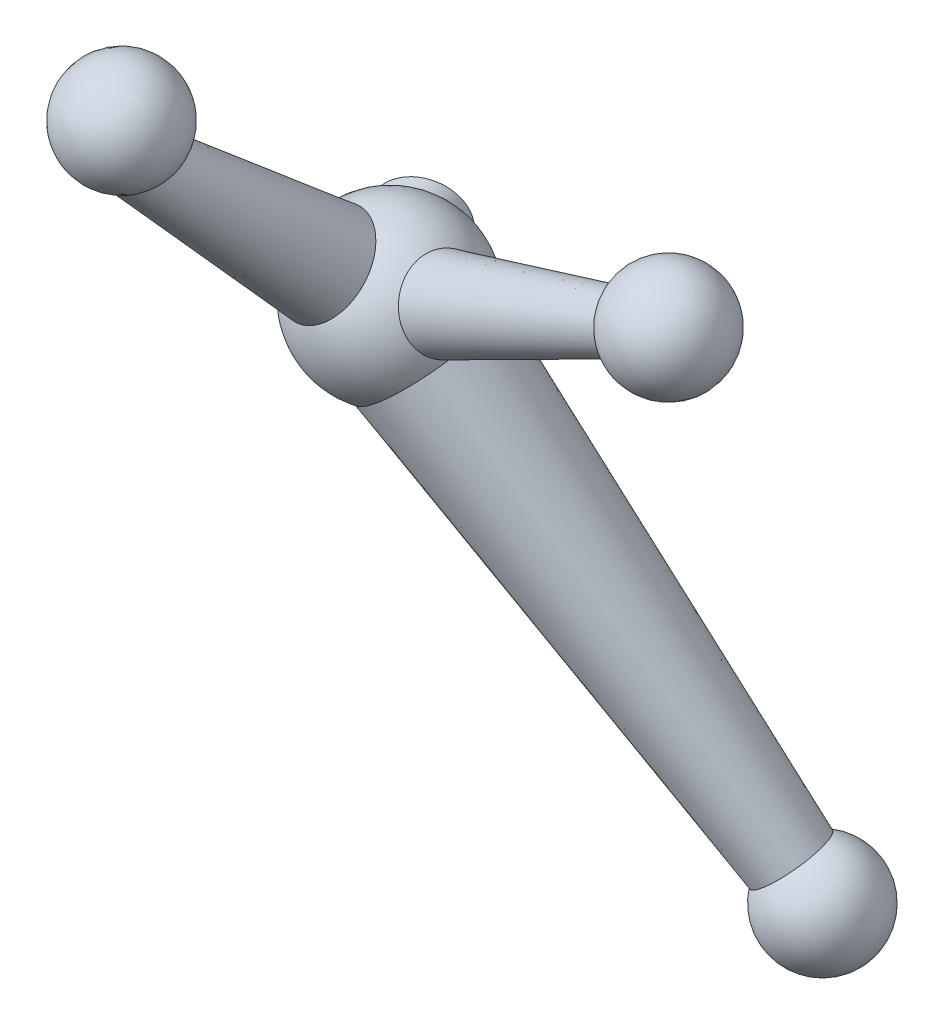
ISO-10303-21;
HEADER;
FILE_DESCRIPTION(('STEP AP214'),'2;1');
FILE_NAME('part.step','',(''),(''),'','','');
FILE_SCHEMA(('AUTOMOTIVE_DESIGN { 1 0 10303 214 1 1 1 1 }'));
ENDSEC;
DATA;
#1=APPLICATION_CONTEXT('core data for automotive mechanical design processes');
#2=APPLICATION_PROTOCOL_DEFINITION('international standard','automotive_design',2000,#1);
#3=PRODUCT_CONTEXT('',#1,'mechanical');
#4=PRODUCT('Part','Part','',(#3));
#5=PRODUCT_RELATED_PRODUCT_CATEGORY('part','',(#4));
#6=PRODUCT_DEFINITION_FORMATION('','',#4);
#7=PRODUCT_DEFINITION_CONTEXT('part definition',#1,'design');
#8=PRODUCT_DEFINITION('design','',#6,#7);
#9=PRODUCT_DEFINITION_SHAPE('','',#8);
#10=(LENGTH_UNIT() NAMED_UNIT(*) SI_UNIT(.MILLI.,.METRE.));
#11=(NAMED_UNIT(*) PLANE_ANGLE_UNIT() SI_UNIT($,.RADIAN.));
#12=(NAMED_UNIT(*) SI_UNIT($,.STERADIAN.) SOLID_ANGLE_UNIT());
#13=UNCERTAINTY_MEASURE_WITH_UNIT(LENGTH_MEASURE(1.E-05),#10,'distance_accuracy_value','');
#14=(GEOMETRIC_REPRESENTATION_CONTEXT(3) GLOBAL_UNCERTAINTY_ASSIGNED_CONTEXT((#13)) GLOBAL_UNIT_ASSIGNED_CONTEXT((#10,
#11,#12)) REPRESENTATION_CONTEXT('',''));
#15=CARTESIAN_POINT('',(0.,0.,0.));
#16=DIRECTION('',(0.,0.,1.));
#17=DIRECTION('',(1.,0.,0.));
#18=AXIS2_PLACEMENT_3D('',#15,#16,#17);
#19=CARTESIAN_POINT('',(-24.1178930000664,165.124999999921,-114.376701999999));
#20=DIRECTION('',(0.503247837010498,-0.0927678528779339,0.859148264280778));
#21=DIRECTION('',(0.862869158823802,0.,-0.505427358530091));
#22=AXIS2_PLACEMENT_3D('',#19,#20,#21);
#23=CONICAL_SURFACE('',#22,8.32050086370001,0.0624188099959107);
#24=CARTESIAN_POINT('',(29.6795172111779,155.208076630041,-22.5333830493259));
#25=DIRECTION('',(0.503247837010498,-0.0927678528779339,0.859148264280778));
#26=DIRECTION('',(0.862869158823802,0.,-0.505427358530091));
#27=AXIS2_PLACEMENT_3D('',#24,#25,#26);
#28=CIRCLE('',#27,15.0017777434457);
#29=CARTESIAN_POINT('',(42.6240885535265,155.208076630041,-30.1156919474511));
#30=VERTEX_POINT('',#29);
#31=EDGE_CURVE('E53',#30,#30,#28,.T.);
#32=ORIENTED_EDGE('',*,*,#31,.F.);
#33=EDGE_LOOP('',(#32));
#34=FACE_BOUND('',#33,.T.);
#35=CARTESIAN_POINT('',(26.00886560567,155.884718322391,-28.7999454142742));
#36=DIRECTION('',(0.503247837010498,-0.0927678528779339,0.859148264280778));
#37=DIRECTION('',(0.862869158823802,0.,-0.505427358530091));
#38=AXIS2_PLACEMENT_3D('',#35,#36,#37);
#39=CIRCLE('',#38,14.5459074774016);
#40=CARTESIAN_POINT('',(38.5600805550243,155.884718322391,-36.1518450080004));
#41=VERTEX_POINT('',#40);
#42=EDGE_CURVE('E11',#41,#41,#39,.F.);
#43=ORIENTED_EDGE('',*,*,#42,.F.);
#44=EDGE_LOOP('',(#43));
#45=FACE_BOUND('',#44,.T.);
#46=ADVANCED_FACE('F32',(#34,#45),#23,.T.);
#47=CARTESIAN_POINT('',(11.7205358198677,230.396919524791,70.3005693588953));
#48=DIRECTION('',(-0.693319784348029,-0.636788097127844,0.337355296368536));
#49=DIRECTION('',(0.503247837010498,-0.0927678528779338,0.859148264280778));
#50=AXIS2_PLACEMENT_3D('',#47,#48,#49);
#51=SPHERICAL_SURFACE('',#50,20.);
#52=CARTESIAN_POINT('',(8.26631759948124,215.792868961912,57.0797492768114));
#53=CARTESIAN_POINT('',(8.43378922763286,215.952521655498,56.859636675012));
#54=CARTESIAN_POINT('',(8.61126793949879,216.112904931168,56.6476805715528));
#55=CARTESIAN_POINT('',(8.98546527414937,216.433828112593,56.2416427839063));
#56=CARTESIAN_POINT('',(9.18218203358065,216.594368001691,56.0475593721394));
#57=CARTESIAN_POINT('',(9.59387393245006,216.914251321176,55.678773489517));
#58=CARTESIAN_POINT('',(9.8088473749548,217.073594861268,55.5040692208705));
#59=CARTESIAN_POINT('',(10.255892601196,217.389728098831,55.1754333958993));
#60=CARTESIAN_POINT('',(10.4879646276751,217.546517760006,55.0215021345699));
#61=CARTESIAN_POINT('',(10.9683238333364,217.856484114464,54.7354146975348));
#62=CARTESIAN_POINT('',(11.2166443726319,218.009652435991,54.603305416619));
#63=CARTESIAN_POINT('',(11.7274518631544,218.310648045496,54.3624271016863));
#64=CARTESIAN_POINT('',(11.9899388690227,218.45847531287,54.2536581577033));
#65=CARTESIAN_POINT('',(12.5272540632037,218.747429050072,54.0604661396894));
#66=CARTESIAN_POINT('',(12.8020814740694,218.888555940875,53.9760415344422));
#67=CARTESIAN_POINT('',(13.3620989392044,219.162823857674,53.8323353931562));
#68=CARTESIAN_POINT('',(13.6472886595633,219.295965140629,53.7730530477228));
#69=CARTESIAN_POINT('',(14.2152355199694,219.548322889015,53.6819229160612));
#70=CARTESIAN_POINT('',(14.4976964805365,219.667871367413,53.6491464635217));
#71=CARTESIAN_POINT('',(15.0682017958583,219.897447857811,53.6077806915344));
#72=CARTESIAN_POINT('',(15.3562460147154,220.007476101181,53.5991907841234));
#73=CARTESIAN_POINT('',(15.9357569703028,220.217115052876,53.6063057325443));
#74=CARTESIAN_POINT('',(16.2272232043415,220.316727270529,53.6220070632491));
#75=CARTESIAN_POINT('',(16.8114460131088,220.504792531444,53.6775913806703));
#76=CARTESIAN_POINT('',(17.1042025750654,220.593245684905,53.7174741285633));
#77=CARTESIAN_POINT('',(17.6821392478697,220.756483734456,53.8199156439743));
#78=CARTESIAN_POINT('',(17.9673398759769,220.831534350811,53.8819364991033));
#79=CARTESIAN_POINT('',(18.5348405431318,220.969932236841,54.028267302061));
#80=CARTESIAN_POINT('',(18.8171406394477,221.033279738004,54.1125768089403));
#81=CARTESIAN_POINT('',(19.3768432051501,221.147954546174,54.3028115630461));
#82=CARTESIAN_POINT('',(19.654245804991,221.199282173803,54.4087362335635));
#83=CARTESIAN_POINT('',(20.2022401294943,221.289739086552,54.6413673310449));
#84=CARTESIAN_POINT('',(20.4728317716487,221.328868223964,54.7680740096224));
#85=CARTESIAN_POINT('',(21.0074396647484,221.395135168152,55.0423466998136));
#86=CARTESIAN_POINT('',(21.2713885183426,221.422177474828,55.1900670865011));
#87=CARTESIAN_POINT('',(21.7887469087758,221.463903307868,55.5044748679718));
#88=CARTESIAN_POINT('',(22.0421564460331,221.478586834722,55.6711622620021));
#89=CARTESIAN_POINT('',(22.5368275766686,221.49579789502,56.0222662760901));
#90=CARTESIAN_POINT('',(22.7780884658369,221.498324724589,56.2066839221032));
#91=CARTESIAN_POINT('',(23.2469809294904,221.491533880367,56.5919130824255));
#92=CARTESIAN_POINT('',(23.4746116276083,221.482215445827,56.7927256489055));
#93=CARTESIAN_POINT('',(23.9227330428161,221.451609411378,57.2167416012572));
#94=CARTESIAN_POINT('',(24.1426826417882,221.429908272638,57.4404870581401));
#95=CARTESIAN_POINT('',(24.5652375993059,221.374797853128,57.902435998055));
#96=CARTESIAN_POINT('',(24.7678426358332,221.341388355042,58.1406397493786));
#97=CARTESIAN_POINT('',(25.1546224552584,221.263492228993,58.6298969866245));
#98=CARTESIAN_POINT('',(25.3387947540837,221.21900411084,58.8809521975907));
#99=CARTESIAN_POINT('',(25.687751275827,221.11965437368,59.3942394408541));
#100=CARTESIAN_POINT('',(25.8525344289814,221.064792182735,59.6564720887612));
#101=CARTESIAN_POINT('',(26.1706030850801,220.942106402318,60.2054119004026));
#102=CARTESIAN_POINT('',(26.3227291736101,220.873729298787,60.4926674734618));
#103=CARTESIAN_POINT('',(26.6037967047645,220.727178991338,61.0758834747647));
#104=CARTESIAN_POINT('',(26.7327373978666,220.649005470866,61.3718441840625));
#105=CARTESIAN_POINT('',(26.9669376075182,220.483806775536,61.9706460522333));
#106=CARTESIAN_POINT('',(27.0721926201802,220.396779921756,62.273488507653));
#107=CARTESIAN_POINT('',(27.258648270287,220.214856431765,62.884177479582));
#108=CARTESIAN_POINT('',(27.3398475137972,220.119959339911,63.1920242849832));
#109=CARTESIAN_POINT('',(27.4825260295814,219.916812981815,63.8312447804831));
#110=CARTESIAN_POINT('',(27.5423624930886,219.808096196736,64.1628371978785));
#111=CARTESIAN_POINT('',(27.6344345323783,219.583987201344,64.8275914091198));
#112=CARTESIAN_POINT('',(27.6666690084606,219.468594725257,65.1607532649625));
#113=CARTESIAN_POINT('',(27.7036366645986,219.232234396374,65.8267011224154));
#114=CARTESIAN_POINT('',(27.7083637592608,219.111265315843,66.1594870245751));
#115=CARTESIAN_POINT('',(27.690534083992,218.864853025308,66.822664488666));
#116=CARTESIAN_POINT('',(27.6679761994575,218.739409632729,67.1530559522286));
#117=CARTESIAN_POINT('',(27.5937446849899,218.477386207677,67.8293844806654));
#118=CARTESIAN_POINT('',(27.5403946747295,218.34059117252,68.1750551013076));
#119=CARTESIAN_POINT('',(27.4039398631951,218.064256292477,68.8593601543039));
#120=CARTESIAN_POINT('',(27.3208338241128,217.924716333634,69.1979942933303));
#121=CARTESIAN_POINT('',(27.1255123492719,217.643932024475,69.8660348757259));
#122=CARTESIAN_POINT('',(27.0132969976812,217.502687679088,70.1954413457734));
#123=CARTESIAN_POINT('',(26.7604369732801,217.219358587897,70.8429810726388));
#124=CARTESIAN_POINT('',(26.6197794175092,217.077273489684,71.1611091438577));
#125=CARTESIAN_POINT('',(26.305827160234,216.788481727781,71.7938882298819));
#126=CARTESIAN_POINT('',(26.1316158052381,216.641775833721,72.1080855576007));
#127=CARTESIAN_POINT('',(25.7548546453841,216.349202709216,72.7191901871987));
#128=CARTESIAN_POINT('',(25.5523183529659,216.203335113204,73.0161056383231));
#129=CARTESIAN_POINT('',(25.119714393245,215.912797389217,73.5903560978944));
#130=CARTESIAN_POINT('',(24.8896193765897,215.768128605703,73.8676712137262));
#131=CARTESIAN_POINT('',(24.4032947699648,215.480556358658,74.3993731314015));
#132=CARTESIAN_POINT('',(24.1470667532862,215.337652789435,74.6537613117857));
#133=CARTESIAN_POINT('',(23.6185790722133,215.058446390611,75.1284807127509));
#134=CARTESIAN_POINT('',(23.3471041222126,214.922079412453,75.3496463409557));
#135=CARTESIAN_POINT('',(22.7825516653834,214.651334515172,75.7640184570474));
#136=CARTESIAN_POINT('',(22.4894722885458,214.516956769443,75.9572225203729));
#137=CARTESIAN_POINT('',(21.8843972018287,214.250561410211,76.3115100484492));
#138=CARTESIAN_POINT('',(21.5724433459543,214.118539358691,76.4726614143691));
#139=CARTESIAN_POINT('',(20.931727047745,213.856702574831,76.7593105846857));
#140=CARTESIAN_POINT('',(20.6029727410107,213.726886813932,76.8848254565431));
#141=CARTESIAN_POINT('',(20.0311328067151,213.507716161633,77.0650738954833));
#142=CARTESIAN_POINT('',(19.791393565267,213.417725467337,77.1297647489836));
#143=CARTESIAN_POINT('',(19.3067271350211,213.239184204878,77.2382497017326));
#144=CARTESIAN_POINT('',(19.0618011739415,213.150633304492,77.2820486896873));
#145=CARTESIAN_POINT('',(18.5686058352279,212.975341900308,77.3477028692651));
#146=CARTESIAN_POINT('',(18.3203393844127,212.888599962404,77.3695761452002));
#147=CARTESIAN_POINT('',(17.8220815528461,212.717274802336,77.390760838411));
#148=CARTESIAN_POINT('',(17.5720901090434,212.632691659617,77.3900714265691));
#149=CARTESIAN_POINT('',(17.0718774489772,212.466090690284,77.3658562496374));
#150=CARTESIAN_POINT('',(16.8216565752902,212.384077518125,77.3422912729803));
#151=CARTESIAN_POINT('',(16.3233126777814,212.223410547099,77.2724969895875));
#152=CARTESIAN_POINT('',(16.0751896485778,212.144756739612,77.2262677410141));
#153=CARTESIAN_POINT('',(15.5826953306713,211.991471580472,77.1118121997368));
#154=CARTESIAN_POINT('',(15.3383257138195,211.916841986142,77.043576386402));
#155=CARTESIAN_POINT('',(14.8549871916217,211.772349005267,76.8861905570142));
#156=CARTESIAN_POINT('',(14.6160183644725,211.702485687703,76.7970402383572));
#157=CARTESIAN_POINT('',(14.1480959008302,211.56915494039,76.6005767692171));
#158=CARTESIAN_POINT('',(13.9190484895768,211.505611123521,76.4935378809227));
#159=CARTESIAN_POINT('',(13.4683461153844,211.384391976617,76.2618492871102));
#160=CARTESIAN_POINT('',(13.2466937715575,211.32671871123,76.1371934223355));
#161=CARTESIAN_POINT('',(12.8116494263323,211.217799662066,75.8718091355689));
#162=CARTESIAN_POINT('',(12.5982562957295,211.166552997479,75.7310829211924));
#163=CARTESIAN_POINT('',(12.1802024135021,211.070910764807,75.4349656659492));
#164=CARTESIAN_POINT('',(11.9755448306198,211.026517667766,75.2795693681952));
#165=CARTESIAN_POINT('',(11.5477465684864,210.939327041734,74.9330934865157));
#166=CARTESIAN_POINT('',(11.325973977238,210.897602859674,74.7400530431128));
#167=CARTESIAN_POINT('',(10.8948466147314,210.823979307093,74.3386873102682));
#168=CARTESIAN_POINT('',(10.68549723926,210.792084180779,74.1303554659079));
#169=CARTESIAN_POINT('',(10.2796774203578,210.738469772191,73.7001938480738));
#170=CARTESIAN_POINT('',(10.0832100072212,210.716752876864,73.4783609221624));
#171=CARTESIAN_POINT('',(9.70356782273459,210.683745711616,73.0228510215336));
#172=CARTESIAN_POINT('',(9.52039437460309,210.672456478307,72.7891728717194));
#173=CARTESIAN_POINT('',(9.13802720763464,210.65945973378,72.2712698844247));
#174=CARTESIAN_POINT('',(8.94132172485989,210.659683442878,71.9851545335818));
#175=CARTESIAN_POINT('',(8.56711923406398,210.674712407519,71.4009860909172));
#176=CARTESIAN_POINT('',(8.3896240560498,210.689519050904,71.1029318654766));
#177=CARTESIAN_POINT('',(8.05437810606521,210.733724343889,70.4968141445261));
#178=CARTESIAN_POINT('',(7.89663510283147,210.763128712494,70.188746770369));
#179=CARTESIAN_POINT('',(7.60159052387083,210.836418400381,69.564643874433));
#180=CARTESIAN_POINT('',(7.46428996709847,210.880304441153,69.2486079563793));
#181=CARTESIAN_POINT('',(7.19834277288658,210.98734183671,68.5791429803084));
#182=CARTESIAN_POINT('',(7.07186292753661,211.051959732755,68.2250846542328));
#183=CARTESIAN_POINT('',(6.84518234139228,211.197954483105,67.5120248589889));
#184=CARTESIAN_POINT('',(6.74498342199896,211.279332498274,67.1530230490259));
#185=CARTESIAN_POINT('',(6.57172578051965,211.458252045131,66.4325060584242));
#186=CARTESIAN_POINT('',(6.49866655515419,211.555793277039,66.0709909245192));
#187=CARTESIAN_POINT('',(6.38048023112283,211.76634063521,65.3477157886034));
#188=CARTESIAN_POINT('',(6.33536538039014,211.879353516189,64.9859557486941));
#189=CARTESIAN_POINT('',(6.27344433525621,212.121598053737,64.259763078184));
#190=CARTESIAN_POINT('',(6.25704369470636,212.251034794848,63.8953640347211));
#191=CARTESIAN_POINT('',(6.25448516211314,212.523679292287,63.171827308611));
#192=CARTESIAN_POINT('',(6.26831315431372,212.666880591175,62.812687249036));
#193=CARTESIAN_POINT('',(6.3267335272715,212.965825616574,62.1022001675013));
#194=CARTESIAN_POINT('',(6.37132586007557,213.121569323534,61.7508531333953));
#195=CARTESIAN_POINT('',(6.49164953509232,213.444138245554,61.058745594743));
#196=CARTESIAN_POINT('',(6.56737787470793,213.610962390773,60.7179840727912));
#197=CARTESIAN_POINT('',(6.7416960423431,213.938248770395,60.0806648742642));
#198=CARTESIAN_POINT('',(6.83753727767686,214.097881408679,59.7829268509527));
#199=CARTESIAN_POINT('',(7.0549300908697,214.42359110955,59.2006607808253));
#200=CARTESIAN_POINT('',(7.17647953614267,214.58966763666,58.9161316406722));
#201=CARTESIAN_POINT('',(7.44495511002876,214.926739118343,58.362566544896));
#202=CARTESIAN_POINT('',(7.59186959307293,215.097731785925,58.0935235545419));
#203=CARTESIAN_POINT('',(7.91060797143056,215.443145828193,57.5729595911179));
#204=CARTESIAN_POINT('',(8.08243026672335,215.617566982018,57.3214374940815));
#205=CARTESIAN_POINT('',(8.26631759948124,215.792868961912,57.0797492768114));
#206=B_SPLINE_CURVE_WITH_KNOTS('',3,(#52,#53,#54,#55,#56,#57,#58,#59,#60,#61,#62,#63,#64,#65,
#66,#67,#68,#69,#70,#71,#72,#73,#74,#75,#76,#77,#78,#79,#80,#81,#82,#83,#84,#85,#86,#87,#88,#89,
#90,#91,#92,#93,#94,#95,#96,#97,#98,#99,#100,#101,#102,#103,#104,#105,#106,#107,#108,#109,#110,
#111,#112,#113,#114,#115,#116,#117,#118,#119,#120,#121,#122,#123,#124,#125,#126,#127,#128,#129,
#130,#131,#132,#133,#134,#135,#136,#137,#138,#139,#140,#141,#142,#143,#144,#145,#146,#147,#148,
#149,#150,#151,#152,#153,#154,#155,#156,#157,#158,#159,#160,#161,#162,#163,#164,#165,#166,#167,
#168,#169,#170,#171,#172,#173,#174,#175,#176,#177,#178,#179,#180,#181,#182,#183,#184,#185,#186,
#187,#188,#189,#190,#191,#192,#193,#194,#195,#196,#197,#198,#199,#200,#201,#202,#203,#204,#205),
.UNSPECIFIED.,.T.,.F.,(4,2,2,2,2,2,2,2,2,2,2,2,2,2,2,2,2,2,2,2,2,2,2,2,2,2,2,2,2,2,2,2,2,2,2,2,
2,2,2,2,2,2,2,2,2,2,2,2,2,2,2,2,2,2,2,2,2,2,2,2,2,2,2,2,2,2,2,2,2,2,2,2,2,2,2,2,4),(0.,
0.957768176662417,1.91544367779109,2.87303026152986,3.83063044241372,4.79026243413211,
5.74989812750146,6.70947344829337,7.66901787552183,8.5932778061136,9.5175152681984,
10.4416186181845,11.3657128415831,12.2687314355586,13.1717321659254,14.0747088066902,
14.9776963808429,15.8876976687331,16.797698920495,17.7077528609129,18.6178652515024,
19.5603169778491,20.5027861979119,21.4453822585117,22.3880303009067,23.3834284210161,
24.3788587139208,25.3744781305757,26.3701552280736,27.4311405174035,28.4921680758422,
29.5534303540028,30.6147359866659,31.7401478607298,32.8656065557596,33.9910619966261,
35.1170283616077,36.2798053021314,37.4420294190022,38.605416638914,39.7687338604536,
40.894491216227,42.0203461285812,43.1437899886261,44.2666948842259,45.0582515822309,
45.8496229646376,46.640341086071,47.4310882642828,48.2231932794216,49.0152962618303,
49.8077423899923,50.6001999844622,51.3814669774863,52.163007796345,52.9444413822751,
53.7261560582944,54.6161832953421,55.5065943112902,56.3972140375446,57.287922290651,
58.3284602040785,59.3690971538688,60.4101421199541,61.4512389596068,62.5943654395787,
63.7375711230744,64.8807556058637,66.0244407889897,67.1841526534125,68.3433230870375,
69.5024917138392,70.6615485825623,71.7138345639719,72.7660332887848,73.8177502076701,
74.8693995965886),.UNSPECIFIED.);
#207=CARTESIAN_POINT('',(8.26631759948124,215.792868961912,57.0797492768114));
#208=VERTEX_POINT('',#207);
#209=EDGE_CURVE('E90',#208,#208,#206,.T.);
#210=ORIENTED_EDGE('',*,*,#209,.F.);
#211=EDGE_LOOP('',(#210));
#212=FACE_BOUND('',#211,.T.);
#213=ADVANCED_FACE('F98',(#212),#51,.T.);
#214=CARTESIAN_POINT('',(162.246365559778,209.943892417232,14.1923859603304));
#215=DIRECTION('',(-0.693319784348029,-0.636788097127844,0.337355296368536));
#216=DIRECTION('',(0.503247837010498,-0.0927678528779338,0.859148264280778));
#217=AXIS2_PLACEMENT_3D('',#214,#215,#216);
#218=SPHERICAL_SURFACE('',#217,20.);
#219=CARTESIAN_POINT('',(150.233339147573,195.793721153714,6.74524895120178));
#220=CARTESIAN_POINT('',(150.281447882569,195.641649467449,6.95659070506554));
#221=CARTESIAN_POINT('',(150.325042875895,195.497374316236,7.17453080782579));
#222=CARTESIAN_POINT('',(150.402923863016,195.225354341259,7.62217752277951));
#223=CARTESIAN_POINT('',(150.437207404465,195.097613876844,7.85188721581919));
#224=CARTESIAN_POINT('',(150.496233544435,194.859501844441,8.32162378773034));
#225=CARTESIAN_POINT('',(150.520965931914,194.749148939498,8.56166140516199));
#226=CARTESIAN_POINT('',(150.560663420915,194.54675641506,9.05012467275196));
#227=CARTESIAN_POINT('',(150.575628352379,194.45471711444,9.29855046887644));
#228=CARTESIAN_POINT('',(150.595678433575,194.289651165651,9.80189205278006));
#229=CARTESIAN_POINT('',(150.600768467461,194.216615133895,10.0568045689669));
#230=CARTESIAN_POINT('',(150.601047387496,194.090014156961,10.571429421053));
#231=CARTESIAN_POINT('',(150.596236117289,194.03644951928,10.8311418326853));
#232=CARTESIAN_POINT('',(150.576748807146,193.949185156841,11.3534484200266));
#233=CARTESIAN_POINT('',(150.562075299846,193.915480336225,11.6160418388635));
#234=CARTESIAN_POINT('',(150.522970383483,193.868153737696,12.1423095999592));
#235=CARTESIAN_POINT('',(150.49853897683,193.854531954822,12.405983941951));
#236=CARTESIAN_POINT('',(150.440088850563,193.847467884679,12.9325669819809));
#237=CARTESIAN_POINT('',(150.406069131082,193.854027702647,13.195475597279));
#238=CARTESIAN_POINT('',(150.32868523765,193.887284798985,13.7186307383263));
#239=CARTESIAN_POINT('',(150.285321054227,193.913982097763,13.9788772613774));
#240=CARTESIAN_POINT('',(150.189554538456,193.98732591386,14.4948685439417));
#241=CARTESIAN_POINT('',(150.137151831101,194.033973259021,14.7506131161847));
#242=CARTESIAN_POINT('',(150.023682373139,194.146885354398,15.2557697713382));
#243=CARTESIAN_POINT('',(149.962615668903,194.213149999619,15.5051818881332));
#244=CARTESIAN_POINT('',(149.8322532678,194.364824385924,15.9958976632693));
#245=CARTESIAN_POINT('',(149.762957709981,194.45023380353,16.2372014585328));
#246=CARTESIAN_POINT('',(149.616629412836,194.639591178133,16.7099895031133));
#247=CARTESIAN_POINT('',(149.539596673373,194.743539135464,16.941473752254));
#248=CARTESIAN_POINT('',(149.378355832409,194.969214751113,17.3929373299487));
#249=CARTESIAN_POINT('',(149.294148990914,195.090939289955,17.6129186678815));
#250=CARTESIAN_POINT('',(149.119116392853,195.351361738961,18.0399307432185));
#251=CARTESIAN_POINT('',(149.02828835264,195.490065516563,18.2469569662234));
#252=CARTESIAN_POINT('',(148.840702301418,195.78339967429,18.6464667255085));
#253=CARTESIAN_POINT('',(148.743945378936,195.938027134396,18.838952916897));
#254=CARTESIAN_POINT('',(148.545172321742,196.262133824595,19.2080600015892));
#255=CARTESIAN_POINT('',(148.443156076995,196.431613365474,19.3846805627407));
#256=CARTESIAN_POINT('',(148.234593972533,196.784212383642,19.7207922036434));
#257=CARTESIAN_POINT('',(148.128048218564,196.967331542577,19.8802836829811));
#258=CARTESIAN_POINT('',(147.911179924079,197.34591563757,20.1810113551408));
#259=CARTESIAN_POINT('',(147.800857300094,197.541380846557,20.3222471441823));
#260=CARTESIAN_POINT('',(147.577223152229,197.943261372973,20.5854536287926));
#261=CARTESIAN_POINT('',(147.46391166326,198.149676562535,20.7074245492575));
#262=CARTESIAN_POINT('',(147.23510414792,198.571991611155,20.9312361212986));
#263=CARTESIAN_POINT('',(147.119608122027,198.78789146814,21.0330767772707));
#264=CARTESIAN_POINT('',(146.887252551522,199.227641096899,21.2159038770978));
#265=CARTESIAN_POINT('',(146.77039300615,199.451490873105,21.2968903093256));
#266=CARTESIAN_POINT('',(146.536141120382,199.905549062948,21.4374332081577));
#267=CARTESIAN_POINT('',(146.41874877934,200.135757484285,21.496989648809));
#268=CARTESIAN_POINT('',(146.184265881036,200.600896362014,21.5942490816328));
#269=CARTESIAN_POINT('',(146.06717532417,200.83582682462,21.631952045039));
#270=CARTESIAN_POINT('',(145.834129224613,201.308737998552,21.6852362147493));
#271=CARTESIAN_POINT('',(145.718173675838,201.546718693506,21.7008175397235));
#272=CARTESIAN_POINT('',(145.488221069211,202.024040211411,21.7097480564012));
#273=CARTESIAN_POINT('',(145.374224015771,202.263381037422,21.7030971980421));
#274=CARTESIAN_POINT('',(145.148999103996,202.741720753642,21.6676105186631));
#275=CARTESIAN_POINT('',(145.037771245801,202.980719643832,21.6387746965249));
#276=CARTESIAN_POINT('',(144.818894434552,203.456635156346,21.5591300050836));
#277=CARTESIAN_POINT('',(144.711244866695,203.693552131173,21.5083249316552));
#278=CARTESIAN_POINT('',(144.500232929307,204.163743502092,21.3850821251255));
#279=CARTESIAN_POINT('',(144.396872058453,204.397016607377,21.3126369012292));
#280=CARTESIAN_POINT('',(144.19523041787,204.85813544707,21.1466503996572));
#281=CARTESIAN_POINT('',(144.096948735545,205.085982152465,21.0531129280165));
#282=CARTESIAN_POINT('',(143.906142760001,205.534675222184,20.8455980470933));
#283=CARTESIAN_POINT('',(143.813618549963,205.75552148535,20.731620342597));
#284=CARTESIAN_POINT('',(143.634988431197,206.188636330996,20.4840383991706));
#285=CARTESIAN_POINT('',(143.548882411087,206.400905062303,20.3504345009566));
#286=CARTESIAN_POINT('',(143.383697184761,206.81536451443,20.0645453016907));
#287=CARTESIAN_POINT('',(143.304618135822,207.017555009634,19.9122595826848));
#288=CARTESIAN_POINT('',(143.154068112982,207.410371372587,19.5901279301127));
#289=CARTESIAN_POINT('',(143.082595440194,207.600999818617,19.4202859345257));
#290=CARTESIAN_POINT('',(142.947717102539,207.969465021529,19.0641446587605));
#291=CARTESIAN_POINT('',(142.884314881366,208.147296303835,18.8778384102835));
#292=CARTESIAN_POINT('',(142.766063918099,208.488813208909,18.4901553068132));
#293=CARTESIAN_POINT('',(142.711215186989,208.65249881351,18.2887784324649));
#294=CARTESIAN_POINT('',(142.610482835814,208.964493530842,17.8724751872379));
#295=CARTESIAN_POINT('',(142.564595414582,209.112809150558,17.657554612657));
#296=CARTESIAN_POINT('',(142.482073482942,209.393120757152,17.2155647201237));
#297=CARTESIAN_POINT('',(142.44544104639,209.525113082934,16.9884926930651));
#298=CARTESIAN_POINT('',(142.381703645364,209.771798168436,16.5238636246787));
#299=CARTESIAN_POINT('',(142.354598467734,209.886491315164,16.2863068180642));
#300=CARTESIAN_POINT('',(142.310106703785,210.097768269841,15.8023875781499));
#301=CARTESIAN_POINT('',(142.292720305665,210.19435172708,15.5560249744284));
#302=CARTESIAN_POINT('',(142.267790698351,210.368718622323,15.0562536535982));
#303=CARTESIAN_POINT('',(142.260247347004,210.446502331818,14.8028450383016));
#304=CARTESIAN_POINT('',(142.25505653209,210.582730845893,14.2907335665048));
#305=CARTESIAN_POINT('',(142.257410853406,210.641172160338,14.0320297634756));
#306=CARTESIAN_POINT('',(142.272000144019,210.738264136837,13.511302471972));
#307=CARTESIAN_POINT('',(142.28423169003,210.776921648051,13.2492801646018));
#308=CARTESIAN_POINT('',(142.318487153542,210.834206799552,12.7236444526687));
#309=CARTESIAN_POINT('',(142.340512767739,210.852830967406,12.460030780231));
#310=CARTESIAN_POINT('',(142.394200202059,210.869905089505,11.9331315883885));
#311=CARTESIAN_POINT('',(142.425862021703,210.868355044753,11.6698460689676));
#312=CARTESIAN_POINT('',(142.4985966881,210.845091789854,11.1454755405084));
#313=CARTESIAN_POINT('',(142.539669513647,210.82337862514,10.8843905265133));
#314=CARTESIAN_POINT('',(142.630934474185,210.759943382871,10.3662751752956));
#315=CARTESIAN_POINT('',(142.681126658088,210.718221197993,10.1092448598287));
#316=CARTESIAN_POINT('',(142.790273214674,210.61506461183,9.6010683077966));
#317=CARTESIAN_POINT('',(142.84922756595,210.553630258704,9.34992205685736));
#318=CARTESIAN_POINT('',(142.975479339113,210.411486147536,8.85529879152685));
#319=CARTESIAN_POINT('',(143.042776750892,210.330776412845,8.61182176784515));
#320=CARTESIAN_POINT('',(143.185236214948,210.150655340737,8.13426775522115));
#321=CARTESIAN_POINT('',(143.260398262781,210.051244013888,7.90019076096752));
#322=CARTESIAN_POINT('',(143.418052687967,209.834426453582,7.44310076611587));
#323=CARTESIAN_POINT('',(143.500545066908,209.717020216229,7.2200877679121));
#324=CARTESIAN_POINT('',(143.672274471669,209.465046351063,6.78670928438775));
#325=CARTESIAN_POINT('',(143.761511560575,209.330478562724,6.57634391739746));
#326=CARTESIAN_POINT('',(143.946093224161,209.045142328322,6.16976307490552));
#327=CARTESIAN_POINT('',(144.041437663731,208.894374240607,5.97354728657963));
#328=CARTESIAN_POINT('',(144.23756026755,208.577703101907,5.59665101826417));
#329=CARTESIAN_POINT('',(144.338338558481,208.411799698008,5.41597090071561));
#330=CARTESIAN_POINT('',(144.544608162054,208.066044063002,5.07143928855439));
#331=CARTESIAN_POINT('',(144.650099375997,207.886192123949,4.90758744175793));
#332=CARTESIAN_POINT('',(144.865066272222,207.513781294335,4.59784491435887));
#333=CARTESIAN_POINT('',(144.974542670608,207.321220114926,4.45195748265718));
#334=CARTESIAN_POINT('',(145.196644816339,206.924858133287,4.17926312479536));
#335=CARTESIAN_POINT('',(145.309269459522,206.721061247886,4.05244960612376));
#336=CARTESIAN_POINT('',(145.536923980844,206.303578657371,3.81872331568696));
#337=CARTESIAN_POINT('',(145.651954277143,206.089891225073,3.71181403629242));
#338=CARTESIAN_POINT('',(145.883583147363,205.654179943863,3.51868381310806));
#339=CARTESIAN_POINT('',(146.000181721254,205.432156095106,3.43246286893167));
#340=CARTESIAN_POINT('',(146.234120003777,204.981346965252,3.28132112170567));
#341=CARTESIAN_POINT('',(146.351459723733,204.752561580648,3.21640064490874));
#342=CARTESIAN_POINT('',(146.586044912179,204.289857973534,3.10832291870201));
#343=CARTESIAN_POINT('',(146.703290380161,204.055939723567,3.06516578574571));
#344=CARTESIAN_POINT('',(146.936848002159,203.584644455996,3.00092343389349));
#345=CARTESIAN_POINT('',(147.053160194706,203.347267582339,2.97983729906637));
#346=CARTESIAN_POINT('',(147.284029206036,202.870733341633,2.95988368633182));
#347=CARTESIAN_POINT('',(147.398586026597,202.631575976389,2.96101618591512));
#348=CARTESIAN_POINT('',(147.625118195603,202.153205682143,2.9854904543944));
#349=CARTESIAN_POINT('',(147.73709381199,201.913992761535,3.00882990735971));
#350=CARTESIAN_POINT('',(147.957680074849,201.437186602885,3.07754882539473));
#351=CARTESIAN_POINT('',(148.066290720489,201.199593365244,3.1229282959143));
#352=CARTESIAN_POINT('',(148.279402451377,200.727654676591,3.23541920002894));
#353=CARTESIAN_POINT('',(148.383902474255,200.493310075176,3.30253621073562));
#354=CARTESIAN_POINT('',(148.58801866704,200.02960127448,3.45802027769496));
#355=CARTESIAN_POINT('',(148.687634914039,199.800236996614,3.54638699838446));
#356=CARTESIAN_POINT('',(148.881325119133,199.348003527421,3.74379195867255));
#357=CARTESIAN_POINT('',(148.975396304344,199.125137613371,3.85284042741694));
#358=CARTESIAN_POINT('',(149.157271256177,198.687610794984,4.09080099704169));
#359=CARTESIAN_POINT('',(149.245075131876,198.472949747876,4.21971275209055));
#360=CARTESIAN_POINT('',(149.413703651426,198.05357645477,4.4963403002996));
#361=CARTESIAN_POINT('',(149.494535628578,197.848853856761,4.64403592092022));
#362=CARTESIAN_POINT('',(149.648725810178,197.450633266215,4.95723253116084));
#363=CARTESIAN_POINT('',(149.722085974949,197.257132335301,5.12272882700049));
#364=CARTESIAN_POINT('',(149.878120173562,196.836019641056,5.51370683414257));
#365=CARTESIAN_POINT('',(149.958568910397,196.611902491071,5.74386723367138));
#366=CARTESIAN_POINT('',(150.106138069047,196.185710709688,6.22767107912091));
#367=CARTESIAN_POINT('',(150.173258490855,195.983636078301,6.48131452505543));
#368=CARTESIAN_POINT('',(150.233339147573,195.793721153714,6.74524895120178));
#369=B_SPLINE_CURVE_WITH_KNOTS('',3,(#219,#220,#221,#222,#223,#224,#225,#226,#227,#228,#229,
#230,#231,#232,#233,#234,#235,#236,#237,#238,#239,#240,#241,#242,#243,#244,#245,#246,#247,#248,
#249,#250,#251,#252,#253,#254,#255,#256,#257,#258,#259,#260,#261,#262,#263,#264,#265,#266,#267,
#268,#269,#270,#271,#272,#273,#274,#275,#276,#277,#278,#279,#280,#281,#282,#283,#284,#285,#286,
#287,#288,#289,#290,#291,#292,#293,#294,#295,#296,#297,#298,#299,#300,#301,#302,#303,#304,#305,
#306,#307,#308,#309,#310,#311,#312,#313,#314,#315,#316,#317,#318,#319,#320,#321,#322,#323,#324,
#325,#326,#327,#328,#329,#330,#331,#332,#333,#334,#335,#336,#337,#338,#339,#340,#341,#342,#343,
#344,#345,#346,#347,#348,#349,#350,#351,#352,#353,#354,#355,#356,#357,#358,#359,#360,#361,#362,
#363,#364,#365,#366,#367,#368),.UNSPECIFIED.,.T.,.F.,(4,2,2,2,2,2,2,2,2,2,2,2,2,2,2,2,2,2,2,2,2,
2,2,2,2,2,2,2,2,2,2,2,2,2,2,2,2,2,2,2,2,2,2,2,2,2,2,2,2,2,2,2,2,2,2,2,2,2,2,2,2,2,2,2,2,2,2,2,2,
2,2,2,2,2,4),(0.,0.794034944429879,1.58827881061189,2.38336945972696,3.17847395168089,
3.97318508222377,4.76790876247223,5.56242843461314,6.35694791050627,7.15155026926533,
7.9461534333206,8.74078957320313,9.53542146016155,10.3300399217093,11.1246583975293,
11.919137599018,12.7138921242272,13.5085011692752,14.3031268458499,15.0977339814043,
15.8923586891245,16.6869741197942,17.4815893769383,18.2762050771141,19.0708217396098,
19.8654394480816,20.6600528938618,21.4546681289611,22.2492834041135,23.0437614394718,
23.8385148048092,24.633124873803,25.4277464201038,26.222354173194,27.0169797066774,
27.8114273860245,28.6062129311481,29.4009994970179,30.1954481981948,30.9900747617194,
31.784683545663,32.579307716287,33.3739204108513,34.1686764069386,34.9631570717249,
35.7577754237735,36.5523937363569,37.3470102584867,38.1416310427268,38.9362498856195,
39.7308677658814,40.5254851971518,41.3201028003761,42.1147278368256,42.9093353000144,
43.7039612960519,44.4985706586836,45.2933235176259,46.0878010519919,46.8824178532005,
47.6770346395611,48.4716635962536,49.2662968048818,50.0608970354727,50.8554964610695,
51.6500130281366,52.4445297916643,53.2392505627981,54.0339587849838,54.8290610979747,
55.6241495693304,56.4183912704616,57.2124240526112,58.2040556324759,59.1956872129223),.UNSPECIFIED.);
#370=CARTESIAN_POINT('',(150.233339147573,195.793721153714,6.74524895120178));
#371=VERTEX_POINT('',#370);
#372=EDGE_CURVE('E62',#371,#371,#369,.T.);
#373=ORIENTED_EDGE('',*,*,#372,.F.);
#374=EDGE_LOOP('',(#373));
#375=FACE_BOUND('',#374,.T.);
#376=ADVANCED_FACE('F94',(#375),#218,.T.);
#377=CARTESIAN_POINT('',(166.727178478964,-2.96992816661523,-39.4532766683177));
#378=DIRECTION('',(-0.693319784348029,-0.636788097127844,0.337355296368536));
#379=DIRECTION('',(0.503247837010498,-0.0927678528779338,0.859148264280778));
#380=AXIS2_PLACEMENT_3D('',#377,#378,#379);
#381=SPHERICAL_SURFACE('',#380,20.);
#382=CARTESIAN_POINT('',(166.727178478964,-2.96992816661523,-39.4532766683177));
#383=DIRECTION('',(0.610517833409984,-0.767751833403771,-0.194486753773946));
#384=DIRECTION('',(0.782697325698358,0.622402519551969,0.));
#385=AXIS2_PLACEMENT_3D('',#382,#383,#384);
#386=SPHERICAL_SURFACE('',#385,20.);
#387=CARTESIAN_POINT('',(157.771811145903,8.29182261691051,-36.6004520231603));
#388=DIRECTION('',(0.610517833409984,-0.767751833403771,-0.194486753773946));
#389=DIRECTION('',(0.782697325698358,0.622402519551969,0.));
#390=AXIS2_PLACEMENT_3D('',#387,#388,#389);
#391=CIRCLE('',#390,13.5954314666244);
#392=CARTESIAN_POINT('',(168.412918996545,16.7536534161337,-36.6004520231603));
#393=VERTEX_POINT('',#392);
#394=EDGE_CURVE('E54',#393,#393,#391,.F.);
#395=ORIENTED_EDGE('',*,*,#394,.F.);
#396=EDGE_LOOP('',(#395));
#397=FACE_BOUND('',#396,.T.);
#398=ADVANCED_FACE('F79',(#397),#386,.T.);
#399=CARTESIAN_POINT('',(162.264034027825,209.940454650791,14.2222084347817));
#400=DIRECTION('',(-0.89677250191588,-0.42940214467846,-0.106831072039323));
#401=DIRECTION('',(-0.0838142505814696,0.401896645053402,-0.911841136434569));
#402=AXIS2_PLACEMENT_3D('',#399,#400,#401);
#403=CONICAL_SURFACE('',#402,8.32050086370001,0.0624188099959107);
#404=ORIENTED_EDGE('',*,*,#372,.T.);
#405=EDGE_LOOP('',(#404));
#406=FACE_BOUND('',#405,.T.);
#407=CARTESIAN_POINT('',(57.3946910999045,170.586640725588,13.9961455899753));
#408=CARTESIAN_POINT('',(57.4068224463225,170.41200378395,14.1303945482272));
#409=CARTESIAN_POINT('',(57.4199061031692,170.234718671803,14.2610722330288));
#410=CARTESIAN_POINT('',(57.4482291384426,169.875200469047,14.5151714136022));
#411=CARTESIAN_POINT('',(57.4634684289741,169.692967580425,14.6385932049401));
#412=CARTESIAN_POINT('',(57.5127977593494,169.139350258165,14.9978188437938));
#413=CARTESIAN_POINT('',(57.5504993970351,168.761045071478,15.2225845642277));
#414=CARTESIAN_POINT('',(57.638157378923,167.985803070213,15.643420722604));
#415=CARTESIAN_POINT('',(57.6882182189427,167.588732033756,15.8392224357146));
#416=CARTESIAN_POINT('',(57.7743230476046,166.984088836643,16.1088181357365));
#417=CARTESIAN_POINT('',(57.804860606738,166.781032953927,16.194666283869));
#418=CARTESIAN_POINT('',(57.8699823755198,166.372235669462,16.3582445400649));
#419=CARTESIAN_POINT('',(57.9045679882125,166.166493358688,16.4359718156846));
#420=CARTESIAN_POINT('',(58.0151355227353,165.544908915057,16.6571070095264));
#421=CARTESIAN_POINT('',(58.0977910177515,165.125702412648,16.7880259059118));
#422=CARTESIAN_POINT('',(58.2839560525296,164.282663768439,17.015331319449));
#423=CARTESIAN_POINT('',(58.3874617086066,163.858832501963,17.1117242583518));
#424=CARTESIAN_POINT('',(58.6180790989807,163.012584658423,17.2685625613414));
#425=CARTESIAN_POINT('',(58.7451019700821,162.590168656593,17.3291397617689));
#426=CARTESIAN_POINT('',(59.0257668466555,161.750542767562,17.4138424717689));
#427=CARTESIAN_POINT('',(59.1794027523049,161.333331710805,17.4379763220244));
#428=CARTESIAN_POINT('',(59.495960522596,160.557142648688,17.4485510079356));
#429=CARTESIAN_POINT('',(59.6558075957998,160.196964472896,17.4389893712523));
#430=CARTESIAN_POINT('',(59.9982622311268,159.489587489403,17.3908427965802));
#431=CARTESIAN_POINT('',(60.1808674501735,159.142387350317,17.3522608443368));
#432=CARTESIAN_POINT('',(60.5680802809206,158.465170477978,17.2466906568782));
#433=CARTESIAN_POINT('',(60.7726794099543,158.135147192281,17.1797133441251));
#434=CARTESIAN_POINT('',(61.2021258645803,157.495588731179,17.0185380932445));
#435=CARTESIAN_POINT('',(61.4269718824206,157.186052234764,16.924341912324));
#436=CARTESIAN_POINT('',(61.8581691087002,156.635818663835,16.7268753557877));
#437=CARTESIAN_POINT('',(62.062044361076,156.391856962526,16.6272301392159));
#438=CARTESIAN_POINT('',(62.4803700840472,155.921121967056,16.4107673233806));
#439=CARTESIAN_POINT('',(62.6948234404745,155.694353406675,16.2939450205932));
#440=CARTESIAN_POINT('',(63.1322115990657,155.258325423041,16.0442636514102));
#441=CARTESIAN_POINT('',(63.355150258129,155.049074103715,15.9113972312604));
#442=CARTESIAN_POINT('',(63.8072916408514,154.648068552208,15.6307686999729));
#443=CARTESIAN_POINT('',(64.0364952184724,154.456316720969,15.4830045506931));
#444=CARTESIAN_POINT('',(64.5916109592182,154.016646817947,15.1116889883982));
#445=CARTESIAN_POINT('',(64.9195609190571,153.776912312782,14.8814517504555));
#446=CARTESIAN_POINT('',(65.5785725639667,153.329189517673,14.3958696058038));
#447=CARTESIAN_POINT('',(65.9096353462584,153.121212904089,14.1405155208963));
#448=CARTESIAN_POINT('',(66.5707002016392,152.734804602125,13.6058982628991));
#449=CARTESIAN_POINT('',(66.900699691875,152.556421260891,13.3265970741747));
#450=CARTESIAN_POINT('',(67.5548180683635,152.227810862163,12.7455796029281));
#451=CARTESIAN_POINT('',(67.8789375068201,152.077581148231,12.4438654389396));
#452=CARTESIAN_POINT('',(68.5228282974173,151.801389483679,11.8133693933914));
#453=CARTESIAN_POINT('',(68.8424293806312,151.675888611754,11.4842116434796));
#454=CARTESIAN_POINT('',(69.4673504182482,151.45124220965,10.804002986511));
#455=CARTESIAN_POINT('',(69.772669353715,151.352098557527,10.4529505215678));
#456=CARTESIAN_POINT('',(70.3644425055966,151.17951460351,9.72994769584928));
#457=CARTESIAN_POINT('',(70.6509179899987,151.106044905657,9.35802180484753));
#458=CARTESIAN_POINT('',(71.2009441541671,150.984277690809,8.59366941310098));
#459=CARTESIAN_POINT('',(71.4644990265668,150.935975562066,8.20124668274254));
#460=CARTESIAN_POINT('',(71.9237877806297,150.870212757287,7.46183046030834));
#461=CARTESIAN_POINT('',(72.1236078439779,150.849037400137,7.11770145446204));
#462=CARTESIAN_POINT('',(72.5009588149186,150.824396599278,6.41684288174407));
#463=CARTESIAN_POINT('',(72.6784940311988,150.820927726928,6.0601157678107));
#464=CARTESIAN_POINT('',(73.0083212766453,150.831787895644,5.33557375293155));
#465=CARTESIAN_POINT('',(73.1606239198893,150.846109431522,4.96776359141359));
#466=CARTESIAN_POINT('',(73.4372317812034,150.892601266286,4.22280772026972));
#467=CARTESIAN_POINT('',(73.5615368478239,150.92477166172,3.84566196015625));
#468=CARTESIAN_POINT('',(73.780357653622,151.007224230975,3.08159569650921));
#469=CARTESIAN_POINT('',(73.8746410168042,151.057641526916,2.6946228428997));
#470=CARTESIAN_POINT('',(74.0299036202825,151.176306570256,1.91671033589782));
#471=CARTESIAN_POINT('',(74.0908827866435,151.244554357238,1.52577067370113));
#472=CARTESIAN_POINT('',(74.1779643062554,151.398346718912,0.743608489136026));
#473=CARTESIAN_POINT('',(74.2040851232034,151.483882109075,0.352386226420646));
#474=CARTESIAN_POINT('',(74.2208055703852,151.671510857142,-0.426812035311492));
#475=CARTESIAN_POINT('',(74.2114089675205,151.773602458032,-0.814788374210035));
#476=CARTESIAN_POINT('',(74.1606412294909,151.979993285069,-1.53707818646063));
#477=CARTESIAN_POINT('',(74.1232891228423,152.082520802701,-1.87218973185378));
#478=CARTESIAN_POINT('',(74.0221228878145,152.298794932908,-2.53466972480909));
#479=CARTESIAN_POINT('',(73.9583113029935,152.412540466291,-2.8620389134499));
#480=CARTESIAN_POINT('',(73.8054241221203,152.65044325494,-3.50697407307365));
#481=CARTESIAN_POINT('',(73.7163448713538,152.774602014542,-3.82453861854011));
#482=CARTESIAN_POINT('',(73.514501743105,153.032502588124,-4.44802434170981));
#483=CARTESIAN_POINT('',(73.4017366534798,153.166244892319,-4.75394492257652));
#484=CARTESIAN_POINT('',(73.1514203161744,153.445819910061,-5.35975189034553));
#485=CARTESIAN_POINT('',(73.0133451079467,153.59186400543,-5.65932357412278));
#486=CARTESIAN_POINT('',(72.7163599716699,153.892524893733,-6.2435721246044));
#487=CARTESIAN_POINT('',(72.5574430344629,154.047144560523,-6.52824393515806));
#488=CARTESIAN_POINT('',(72.2209868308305,154.364326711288,-7.08165409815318));
#489=CARTESIAN_POINT('',(72.04344854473,154.526888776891,-7.35039328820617));
#490=CARTESIAN_POINT('',(71.67189165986,154.859535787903,-7.87128041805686));
#491=CARTESIAN_POINT('',(71.4778724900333,155.029620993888,-8.12342778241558));
#492=CARTESIAN_POINT('',(71.0408697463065,155.40688181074,-8.65247234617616));
#493=CARTESIAN_POINT('',(70.7951984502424,155.615412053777,-8.92618693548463));
#494=CARTESIAN_POINT('',(70.2873344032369,156.042220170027,-9.44947342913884));
#495=CARTESIAN_POINT('',(70.0251436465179,156.260496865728,-9.699048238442));
#496=CARTESIAN_POINT('',(69.4867986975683,156.707314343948,-10.1739453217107));
#497=CARTESIAN_POINT('',(69.2106219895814,156.935871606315,-10.3992265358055));
#498=CARTESIAN_POINT('',(68.6476606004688,157.403271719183,-10.8244386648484));
#499=CARTESIAN_POINT('',(68.3608753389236,157.642115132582,-11.024368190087));
#500=CARTESIAN_POINT('',(67.7258735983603,158.175823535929,-11.4326457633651));
#501=CARTESIAN_POINT('',(67.3760971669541,158.472885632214,-11.6357239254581));
#502=CARTESIAN_POINT('',(66.6706280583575,159.08355158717,-12.0034870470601));
#503=CARTESIAN_POINT('',(66.3149339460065,159.397159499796,-12.1681625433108));
#504=CARTESIAN_POINT('',(65.6035247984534,160.041754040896,-12.4564913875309));
#505=CARTESIAN_POINT('',(65.2478104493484,160.372716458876,-12.5802002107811));
#506=CARTESIAN_POINT('',(64.5419157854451,161.053401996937,-12.7838265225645));
#507=CARTESIAN_POINT('',(64.1917327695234,161.403115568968,-12.863766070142));
#508=CARTESIAN_POINT('',(63.6052452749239,162.015372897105,-12.9597736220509));
#509=CARTESIAN_POINT('',(63.3658649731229,162.27314183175,-12.9877348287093));
#510=CARTESIAN_POINT('',(62.8956529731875,162.797772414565,-13.0189856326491));
#511=CARTESIAN_POINT('',(62.6648189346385,163.064631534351,-13.0222820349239));
#512=CARTESIAN_POINT('',(62.2145878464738,163.606225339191,-13.0031173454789));
#513=CARTESIAN_POINT('',(61.9951723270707,163.880946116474,-12.9806992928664));
#514=CARTESIAN_POINT('',(61.5697977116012,164.437320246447,-12.9093577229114));
#515=CARTESIAN_POINT('',(61.363838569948,164.718973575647,-12.8604342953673));
#516=CARTESIAN_POINT('',(60.9666106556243,165.288544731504,-12.7354260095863));
#517=CARTESIAN_POINT('',(60.7754118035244,165.57648496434,-12.6592204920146));
#518=CARTESIAN_POINT('',(60.4103346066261,166.15496321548,-12.4798599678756));
#519=CARTESIAN_POINT('',(60.2364571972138,166.445501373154,-12.3767035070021));
#520=CARTESIAN_POINT('',(59.9066857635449,167.026879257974,-12.1439980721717));
#521=CARTESIAN_POINT('',(59.7508201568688,167.317718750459,-12.0144082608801));
#522=CARTESIAN_POINT('',(59.4575929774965,167.896323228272,-11.7302237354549));
#523=CARTESIAN_POINT('',(59.3202277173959,168.184088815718,-11.5756340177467));
#524=CARTESIAN_POINT('',(59.0267548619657,168.835398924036,-11.1953832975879));
#525=CARTESIAN_POINT('',(58.8764876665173,169.197130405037,-10.962030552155));
#526=CARTESIAN_POINT('',(58.6719485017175,169.727993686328,-10.5862241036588));
#527=CARTESIAN_POINT('',(58.6073447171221,169.902684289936,-10.4569183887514));
#528=CARTESIAN_POINT('',(58.4845583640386,170.247890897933,-10.1900657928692));
#529=CARTESIAN_POINT('',(58.4263738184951,170.418408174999,-10.0525214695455));
#530=CARTESIAN_POINT('',(58.3711790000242,170.586640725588,-9.91103755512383));
#531=B_SPLINE_CURVE_WITH_KNOTS('',3,(#407,#408,#409,#410,#411,#412,#413,#414,#415,#416,#417,
#418,#419,#420,#421,#422,#423,#424,#425,#426,#427,#428,#429,#430,#431,#432,#433,#434,#435,#436,
#437,#438,#439,#440,#441,#442,#443,#444,#445,#446,#447,#448,#449,#450,#451,#452,#453,#454,#455,
#456,#457,#458,#459,#460,#461,#462,#463,#464,#465,#466,#467,#468,#469,#470,#471,#472,#473,#474,
#475,#476,#477,#478,#479,#480,#481,#482,#483,#484,#485,#486,#487,#488,#489,#490,#491,#492,#493,
#494,#495,#496,#497,#498,#499,#500,#501,#502,#503,#504,#505,#506,#507,#508,#509,#510,#511,#512,
#513,#514,#515,#516,#517,#518,#519,#520,#521,#522,#523,#524,#525,#526,#527,#528,#529,#530),
.UNSPECIFIED.,.F.,.F.,(4,2,2,2,2,2,2,2,2,2,2,2,2,2,2,2,2,2,2,2,2,2,2,2,2,2,2,2,2,2,2,2,2,2,2,2,
2,2,2,2,2,2,2,2,2,2,2,2,2,2,2,2,2,2,2,2,2,2,2,2,2,4),(0.,0.66173006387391,1.32343315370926,
2.64683141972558,3.98182696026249,4.64933787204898,5.31708083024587,6.65584333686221,
7.99435670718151,9.32791188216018,10.6611618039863,11.8418342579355,13.0223852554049,
14.2024825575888,15.3825036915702,16.3809944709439,17.3797591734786,18.3789834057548,
19.3783445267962,20.7771392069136,22.1764469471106,23.5780187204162,24.9794581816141,
26.4049656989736,27.8305747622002,29.2545461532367,30.6782565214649,31.8726333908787,
33.066778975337,34.2604209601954,35.4540694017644,36.6567442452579,37.8594217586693,
39.0614619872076,40.263374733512,41.3194161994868,42.3753561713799,43.4314489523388,
44.4875957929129,45.5687661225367,46.6503009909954,47.7317789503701,48.8132943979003,
50.0804820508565,51.3475170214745,52.616660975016,53.8858744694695,55.3895965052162,
56.8936887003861,58.3957357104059,59.8970250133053,60.9547282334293,62.0121396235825,
63.0677837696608,64.123424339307,65.1837925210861,66.2442179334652,67.3062941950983,
68.3681584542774,69.7330899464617,70.4130783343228,71.0928567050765),.UNSPECIFIED.);
#532=CARTESIAN_POINT('',(72.2249713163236,150.842988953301,6.92755148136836));
#533=VERTEX_POINT('',#532);
#534=CARTESIAN_POINT('',(72.2029334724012,154.379495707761,-7.10226797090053));
#535=VERTEX_POINT('',#534);
#536=EDGE_CURVE('E52',#533,#535,#531,.T.);
#537=ORIENTED_EDGE('',*,*,#536,.T.);
#538=CARTESIAN_POINT('',(66.3986678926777,164.037180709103,2.80192088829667));
#539=DIRECTION('',(-0.89677250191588,-0.42940214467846,-0.106831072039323));
#540=DIRECTION('',(0.431873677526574,-0.901934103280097,0.));
#541=AXIS2_PLACEMENT_3D('',#538,#539,#540);
#542=CIRCLE('',#541,15.0017777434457);
#543=EDGE_CURVE('E56',#535,#533,#542,.F.);
#544=ORIENTED_EDGE('',*,*,#543,.T.);
#545=EDGE_LOOP('',(#537,#544));
#546=FACE_BOUND('',#545,.T.);
#547=ADVANCED_FACE('F61',(#406,#546),#403,.T.);
#548=CARTESIAN_POINT('',(166.727178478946,-2.96992816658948,-39.4532766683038));
#549=DIRECTION('',(-0.610517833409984,0.767751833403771,0.194486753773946));
#550=DIRECTION('',(-0.382851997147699,-0.0711199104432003,-0.921068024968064));
#551=AXIS2_PLACEMENT_3D('',#548,#549,#550);
#552=CONICAL_SURFACE('',#551,12.6786515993,0.0624188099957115);
#553=ORIENTED_EDGE('',*,*,#394,.T.);
#554=EDGE_LOOP('',(#553));
#555=FACE_BOUND('',#554,.T.);
#556=ORIENTED_EDGE('',*,*,#536,.F.);
#557=CARTESIAN_POINT('',(53.8998877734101,138.915131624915,-3.51097931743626));
#558=DIRECTION('',(-0.610517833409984,0.767751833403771,0.194486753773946));
#559=DIRECTION('',(-0.782697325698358,-0.622402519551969,0.));
#560=AXIS2_PLACEMENT_3D('',#557,#558,#559);
#561=CIRCLE('',#560,24.2290196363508);
#562=EDGE_CURVE('E46',#533,#535,#561,.F.);
#563=ORIENTED_EDGE('',*,*,#562,.T.);
#564=EDGE_LOOP('',(#556,#563));
#565=FACE_BOUND('',#564,.T.);
#566=ADVANCED_FACE('F50',(#555,#565),#552,.T.);
#567=CARTESIAN_POINT('',(42.878492,152.775,0.));
#568=DIRECTION('',(-0.693319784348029,-0.636788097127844,0.337355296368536));
#569=DIRECTION('',(0.503247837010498,-0.0927678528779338,0.859148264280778));
#570=AXIS2_PLACEMENT_3D('',#567,#568,#569);
#571=SPHERICAL_SURFACE('',#570,30.2148884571);
#572=ORIENTED_EDGE('',*,*,#31,.T.);
#573=EDGE_LOOP('',(#572));
#574=FACE_BOUND('',#573,.T.);
#575=ORIENTED_EDGE('',*,*,#562,.F.);
#576=ORIENTED_EDGE('',*,*,#543,.F.);
#577=EDGE_LOOP('',(#575,#576));
#578=FACE_BOUND('',#577,.T.);
#579=CARTESIAN_POINT('',(36.1631164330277,169.069502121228,16.9561359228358));
#580=DIRECTION('',(0.274585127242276,-0.666266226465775,-0.69331978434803));
#581=DIRECTION('',(0.,0.721034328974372,-0.692899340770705));
#582=AXIS2_PLACEMENT_3D('',#579,#580,#581);
#583=CIRCLE('',#582,17.7432204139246);
#584=CARTESIAN_POINT('',(36.1631164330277,181.862973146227,4.66187019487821));
#585=VERTEX_POINT('',#584);
#586=EDGE_CURVE('E40',#585,#585,#583,.F.);
#587=ORIENTED_EDGE('',*,*,#586,.F.);
#588=EDGE_LOOP('',(#587));
#589=FACE_BOUND('',#588,.T.);
#590=ADVANCED_FACE('F57',(#574,#578,#589),#571,.T.);
#591=CARTESIAN_POINT('',(13.1220390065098,224.977452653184,75.1342134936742));
#592=DIRECTION('',(0.274585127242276,-0.666266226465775,-0.69331978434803));
#593=DIRECTION('',(0.666266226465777,-0.388059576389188,0.636788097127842));
#594=AXIS2_PLACEMENT_3D('',#591,#592,#593);
#595=CONICAL_SURFACE('',#594,10.,0.0920169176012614);
#596=ORIENTED_EDGE('',*,*,#209,.T.);
#597=EDGE_LOOP('',(#596));
#598=FACE_BOUND('',#597,.T.);
#599=ORIENTED_EDGE('',*,*,#586,.T.);
#600=EDGE_LOOP('',(#599));
#601=FACE_BOUND('',#600,.T.);
#602=ADVANCED_FACE('F81',(#598,#601),#595,.T.);
#603=CARTESIAN_POINT('',(-306.451257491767,-207.726151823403,126.677803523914));
#604=DIRECTION('',(0.503247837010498,-0.0927678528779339,0.859148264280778));
#605=DIRECTION('',(0.862869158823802,0.,-0.505427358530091));
#606=AXIS2_PLACEMENT_3D('',#603,#604,#605);
#607=PLANE('',#606);
#608=ORIENTED_EDGE('',*,*,#42,.T.);
#609=EDGE_LOOP('',(#608));
#610=FACE_BOUND('',#609,.T.);
#611=ADVANCED_FACE('F34',(#610),#607,.F.);
#612=CLOSED_SHELL('',(#46,#213,#376,#398,#547,#566,#590,#602,#611));
#613=MANIFOLD_SOLID_BREP('B2',#612);
#614=ADVANCED_BREP_SHAPE_REPRESENTATION('',(#18,#613),#14);
#615=SHAPE_DEFINITION_REPRESENTATION(#9,#614);
ENDSEC;
END-ISO-10303-21;
